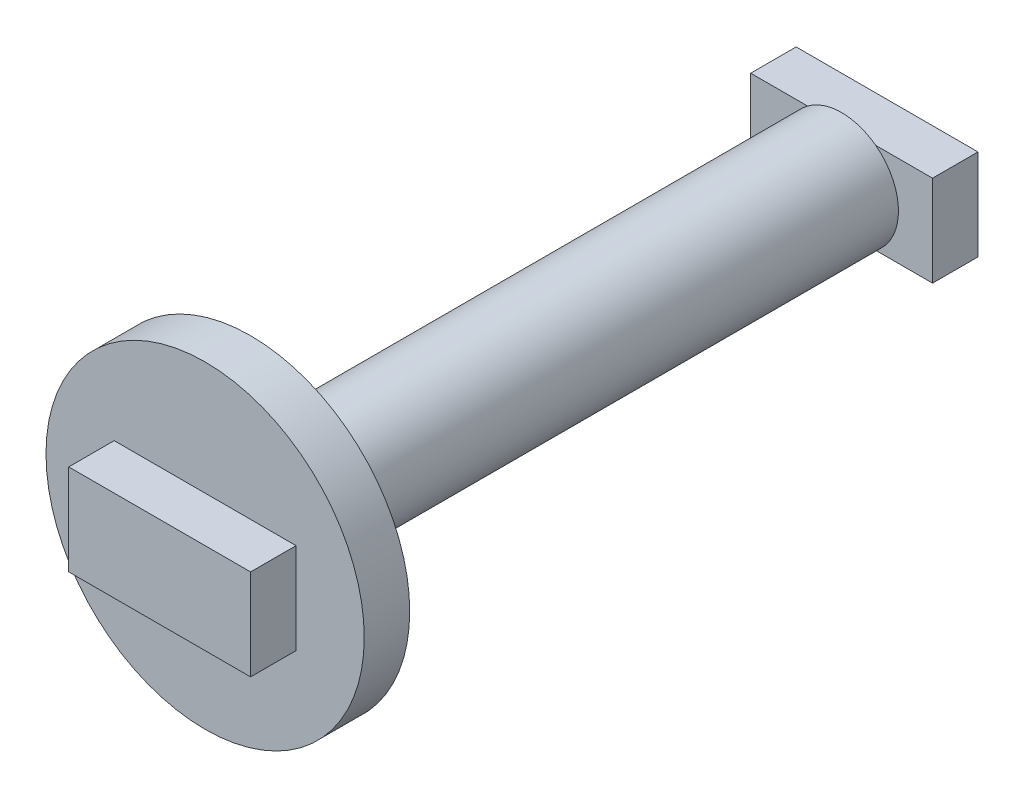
ISO-10303-21;
HEADER;
FILE_DESCRIPTION(('STEP AP214'),'2;1');
FILE_NAME('part.step','',(''),(''),'','','');
FILE_SCHEMA(('AUTOMOTIVE_DESIGN { 1 0 10303 214 1 1 1 1 }'));
ENDSEC;
DATA;
#1=APPLICATION_CONTEXT('core data for automotive mechanical design processes');
#2=APPLICATION_PROTOCOL_DEFINITION('international standard','automotive_design',2000,#1);
#3=PRODUCT_CONTEXT('',#1,'mechanical');
#4=PRODUCT('Part','Part','',(#3));
#5=PRODUCT_RELATED_PRODUCT_CATEGORY('part','',(#4));
#6=PRODUCT_DEFINITION_FORMATION('','',#4);
#7=PRODUCT_DEFINITION_CONTEXT('part definition',#1,'design');
#8=PRODUCT_DEFINITION('design','',#6,#7);
#9=PRODUCT_DEFINITION_SHAPE('','',#8);
#10=(LENGTH_UNIT() NAMED_UNIT(*) SI_UNIT(.MILLI.,.METRE.));
#11=(NAMED_UNIT(*) PLANE_ANGLE_UNIT() SI_UNIT($,.RADIAN.));
#12=(NAMED_UNIT(*) SI_UNIT($,.STERADIAN.) SOLID_ANGLE_UNIT());
#13=UNCERTAINTY_MEASURE_WITH_UNIT(LENGTH_MEASURE(1.E-05),#10,'distance_accuracy_value','');
#14=(GEOMETRIC_REPRESENTATION_CONTEXT(3) GLOBAL_UNCERTAINTY_ASSIGNED_CONTEXT((#13)) GLOBAL_UNIT_ASSIGNED_CONTEXT((#10,
#11,#12)) REPRESENTATION_CONTEXT('',''));
#15=CARTESIAN_POINT('',(0.,0.,0.));
#16=DIRECTION('',(0.,0.,1.));
#17=DIRECTION('',(1.,0.,0.));
#18=AXIS2_PLACEMENT_3D('',#15,#16,#17);
#19=CARTESIAN_POINT('',(0.,0.,0.));
#20=DIRECTION('',(0.,0.,1.));
#21=DIRECTION('',(1.,0.,0.));
#22=AXIS2_PLACEMENT_3D('',#19,#20,#21);
#23=PLANE('',#22);
#24=DIRECTION('',(1.,0.,0.));
#25=VECTOR('',#24,1.);
#26=CARTESIAN_POINT('',(-20.,10.,0.));
#27=LINE('',#26,#25);
#28=CARTESIAN_POINT('',(-7.5,10.,0.));
#29=VERTEX_POINT('',#28);
#30=CARTESIAN_POINT('',(7.5,10.,0.));
#31=VERTEX_POINT('',#30);
#32=EDGE_CURVE('E11',#29,#31,#27,.T.);
#33=ORIENTED_EDGE('',*,*,#32,.F.);
#34=CARTESIAN_POINT('',(0.,0.,0.));
#35=DIRECTION('',(0.,0.,1.));
#36=DIRECTION('',(1.,0.,0.));
#37=AXIS2_PLACEMENT_3D('',#34,#35,#36);
#38=CIRCLE('',#37,12.5);
#39=EDGE_CURVE('E37',#31,#29,#38,.T.);
#40=ORIENTED_EDGE('',*,*,#39,.F.);
#41=EDGE_LOOP('',(#33,#40));
#42=FACE_BOUND('',#41,.T.);
#43=ADVANCED_FACE('F33',(#42),#23,.F.);
#44=DIRECTION('',(-1.,0.,0.));
#45=VECTOR('',#44,1.);
#46=CARTESIAN_POINT('',(-20.,-10.,0.));
#47=LINE('',#46,#45);
#48=CARTESIAN_POINT('',(7.5,-10.,0.));
#49=VERTEX_POINT('',#48);
#50=CARTESIAN_POINT('',(-7.5,-10.,0.));
#51=VERTEX_POINT('',#50);
#52=EDGE_CURVE('E42',#49,#51,#47,.T.);
#53=ORIENTED_EDGE('',*,*,#52,.F.);
#54=EDGE_CURVE('E188',#51,#49,#38,.T.);
#55=ORIENTED_EDGE('',*,*,#54,.F.);
#56=EDGE_LOOP('',(#53,#55));
#57=FACE_BOUND('',#56,.T.);
#58=ADVANCED_FACE('F221',(#57),#23,.F.);
#59=CARTESIAN_POINT('',(0.,0.,140.));
#60=DIRECTION('',(0.,0.,1.));
#61=DIRECTION('',(1.,0.,0.));
#62=AXIS2_PLACEMENT_3D('',#59,#60,#61);
#63=PLANE('',#62);
#64=CARTESIAN_POINT('',(0.,0.,140.));
#65=DIRECTION('',(0.,0.,1.));
#66=DIRECTION('',(1.,0.,0.));
#67=AXIS2_PLACEMENT_3D('',#64,#65,#66);
#68=CIRCLE('',#67,35.);
#69=CARTESIAN_POINT('',(35.,0.,140.));
#70=VERTEX_POINT('',#69);
#71=EDGE_CURVE('E173',#70,#70,#68,.T.);
#72=ORIENTED_EDGE('',*,*,#71,.T.);
#73=EDGE_LOOP('',(#72));
#74=FACE_BOUND('',#73,.T.);
#75=DIRECTION('',(1.,0.,0.));
#76=VECTOR('',#75,1.);
#77=CARTESIAN_POINT('',(20.,-10.,140.));
#78=LINE('',#77,#76);
#79=CARTESIAN_POINT('',(-20.,-10.,140.));
#80=VERTEX_POINT('',#79);
#81=CARTESIAN_POINT('',(20.,-10.,140.));
#82=VERTEX_POINT('',#81);
#83=EDGE_CURVE('E141',#80,#82,#78,.T.);
#84=ORIENTED_EDGE('',*,*,#83,.F.);
#85=DIRECTION('',(0.,-1.,0.));
#86=VECTOR('',#85,1.);
#87=CARTESIAN_POINT('',(-20.,10.,140.));
#88=LINE('',#87,#86);
#89=CARTESIAN_POINT('',(-20.,10.,140.));
#90=VERTEX_POINT('',#89);
#91=EDGE_CURVE('E138',#90,#80,#88,.T.);
#92=ORIENTED_EDGE('',*,*,#91,.F.);
#93=DIRECTION('',(-1.,0.,0.));
#94=VECTOR('',#93,1.);
#95=CARTESIAN_POINT('',(20.,10.,140.));
#96=LINE('',#95,#94);
#97=CARTESIAN_POINT('',(20.,10.,140.));
#98=VERTEX_POINT('',#97);
#99=EDGE_CURVE('E151',#98,#90,#96,.T.);
#100=ORIENTED_EDGE('',*,*,#99,.F.);
#101=DIRECTION('',(0.,1.,0.));
#102=VECTOR('',#101,1.);
#103=CARTESIAN_POINT('',(20.,10.,140.));
#104=LINE('',#103,#102);
#105=EDGE_CURVE('E159',#82,#98,#104,.T.);
#106=ORIENTED_EDGE('',*,*,#105,.F.);
#107=EDGE_LOOP('',(#84,#92,#100,#106));
#108=FACE_BOUND('',#107,.T.);
#109=ADVANCED_FACE('F225',(#74,#108),#63,.T.);
#110=CARTESIAN_POINT('',(0.,0.,130.));
#111=DIRECTION('',(0.,0.,-1.));
#112=DIRECTION('',(-1.,0.,0.));
#113=AXIS2_PLACEMENT_3D('',#110,#111,#112);
#114=CYLINDRICAL_SURFACE('',#113,12.5);
#115=CARTESIAN_POINT('',(0.,0.,130.));
#116=DIRECTION('',(0.,0.,1.));
#117=DIRECTION('',(1.,0.,0.));
#118=AXIS2_PLACEMENT_3D('',#115,#116,#117);
#119=CIRCLE('',#118,12.5);
#120=CARTESIAN_POINT('',(12.5,0.,130.));
#121=VERTEX_POINT('',#120);
#122=EDGE_CURVE('E178',#121,#121,#119,.T.);
#123=ORIENTED_EDGE('',*,*,#122,.F.);
#124=EDGE_LOOP('',(#123));
#125=FACE_BOUND('',#124,.T.);
#126=ORIENTED_EDGE('',*,*,#39,.T.);
#127=EDGE_CURVE('E185',#29,#51,#38,.T.);
#128=ORIENTED_EDGE('',*,*,#127,.T.);
#129=ORIENTED_EDGE('',*,*,#54,.T.);
#130=EDGE_CURVE('E176',#49,#31,#38,.T.);
#131=ORIENTED_EDGE('',*,*,#130,.T.);
#132=EDGE_LOOP('',(#126,#128,#129,#131));
#133=FACE_BOUND('',#132,.T.);
#134=ADVANCED_FACE('F35',(#125,#133),#114,.T.);
#135=CARTESIAN_POINT('',(0.,0.,130.));
#136=DIRECTION('',(0.,0.,1.));
#137=DIRECTION('',(1.,0.,0.));
#138=AXIS2_PLACEMENT_3D('',#135,#136,#137);
#139=PLANE('',#138);
#140=CARTESIAN_POINT('',(0.,0.,130.));
#141=DIRECTION('',(0.,0.,1.));
#142=DIRECTION('',(1.,0.,0.));
#143=AXIS2_PLACEMENT_3D('',#140,#141,#142);
#144=CIRCLE('',#143,35.);
#145=CARTESIAN_POINT('',(35.,0.,130.));
#146=VERTEX_POINT('',#145);
#147=EDGE_CURVE('E172',#146,#146,#144,.T.);
#148=ORIENTED_EDGE('',*,*,#147,.F.);
#149=EDGE_LOOP('',(#148));
#150=FACE_BOUND('',#149,.T.);
#151=ORIENTED_EDGE('',*,*,#122,.T.);
#152=EDGE_LOOP('',(#151));
#153=FACE_BOUND('',#152,.T.);
#154=ADVANCED_FACE('F231',(#150,#153),#139,.F.);
#155=CARTESIAN_POINT('',(0.,0.,140.));
#156=DIRECTION('',(0.,0.,-1.));
#157=DIRECTION('',(-1.,0.,0.));
#158=AXIS2_PLACEMENT_3D('',#155,#156,#157);
#159=CYLINDRICAL_SURFACE('',#158,35.);
#160=ORIENTED_EDGE('',*,*,#71,.F.);
#161=EDGE_LOOP('',(#160));
#162=FACE_BOUND('',#161,.T.);
#163=ORIENTED_EDGE('',*,*,#147,.T.);
#164=EDGE_LOOP('',(#163));
#165=FACE_BOUND('',#164,.T.);
#166=ADVANCED_FACE('F227',(#162,#165),#159,.T.);
#167=CARTESIAN_POINT('',(-20.,10.,150.));
#168=DIRECTION('',(1.,0.,0.));
#169=DIRECTION('',(0.,1.,0.));
#170=AXIS2_PLACEMENT_3D('',#167,#168,#169);
#171=PLANE('',#170);
#172=ORIENTED_EDGE('',*,*,#91,.T.);
#173=DIRECTION('',(0.,0.,-1.));
#174=VECTOR('',#173,1.);
#175=CARTESIAN_POINT('',(-20.,-10.,150.));
#176=LINE('',#175,#174);
#177=CARTESIAN_POINT('',(-20.,-10.,150.));
#178=VERTEX_POINT('',#177);
#179=EDGE_CURVE('E170',#178,#80,#176,.T.);
#180=ORIENTED_EDGE('',*,*,#179,.F.);
#181=DIRECTION('',(0.,-1.,0.));
#182=VECTOR('',#181,1.);
#183=CARTESIAN_POINT('',(-20.,10.,150.));
#184=LINE('',#183,#182);
#185=CARTESIAN_POINT('',(-20.,10.,150.));
#186=VERTEX_POINT('',#185);
#187=EDGE_CURVE('E147',#186,#178,#184,.T.);
#188=ORIENTED_EDGE('',*,*,#187,.F.);
#189=DIRECTION('',(0.,0.,-1.));
#190=VECTOR('',#189,1.);
#191=CARTESIAN_POINT('',(-20.,10.,150.));
#192=LINE('',#191,#190);
#193=EDGE_CURVE('E156',#186,#90,#192,.T.);
#194=ORIENTED_EDGE('',*,*,#193,.T.);
#195=EDGE_LOOP('',(#172,#180,#188,#194));
#196=FACE_BOUND('',#195,.T.);
#197=ADVANCED_FACE('F230',(#196),#171,.F.);
#198=CARTESIAN_POINT('',(20.,-10.,150.));
#199=DIRECTION('',(0.,1.,0.));
#200=DIRECTION('',(-1.,0.,0.));
#201=AXIS2_PLACEMENT_3D('',#198,#199,#200);
#202=PLANE('',#201);
#203=ORIENTED_EDGE('',*,*,#83,.T.);
#204=DIRECTION('',(0.,0.,-1.));
#205=VECTOR('',#204,1.);
#206=CARTESIAN_POINT('',(20.,-10.,150.));
#207=LINE('',#206,#205);
#208=CARTESIAN_POINT('',(20.,-10.,150.));
#209=VERTEX_POINT('',#208);
#210=EDGE_CURVE('E167',#209,#82,#207,.T.);
#211=ORIENTED_EDGE('',*,*,#210,.F.);
#212=DIRECTION('',(1.,0.,0.));
#213=VECTOR('',#212,1.);
#214=CARTESIAN_POINT('',(20.,-10.,150.));
#215=LINE('',#214,#213);
#216=EDGE_CURVE('E150',#178,#209,#215,.T.);
#217=ORIENTED_EDGE('',*,*,#216,.F.);
#218=ORIENTED_EDGE('',*,*,#179,.T.);
#219=EDGE_LOOP('',(#203,#211,#217,#218));
#220=FACE_BOUND('',#219,.T.);
#221=ADVANCED_FACE('F241',(#220),#202,.F.);
#222=CARTESIAN_POINT('',(20.,10.,150.));
#223=DIRECTION('',(-1.,0.,0.));
#224=DIRECTION('',(0.,-1.,0.));
#225=AXIS2_PLACEMENT_3D('',#222,#223,#224);
#226=PLANE('',#225);
#227=ORIENTED_EDGE('',*,*,#105,.T.);
#228=DIRECTION('',(0.,0.,-1.));
#229=VECTOR('',#228,1.);
#230=CARTESIAN_POINT('',(20.,10.,150.));
#231=LINE('',#230,#229);
#232=CARTESIAN_POINT('',(20.,10.,150.));
#233=VERTEX_POINT('',#232);
#234=EDGE_CURVE('E165',#233,#98,#231,.T.);
#235=ORIENTED_EDGE('',*,*,#234,.F.);
#236=DIRECTION('',(0.,1.,0.));
#237=VECTOR('',#236,1.);
#238=CARTESIAN_POINT('',(20.,10.,150.));
#239=LINE('',#238,#237);
#240=EDGE_CURVE('E153',#209,#233,#239,.T.);
#241=ORIENTED_EDGE('',*,*,#240,.F.);
#242=ORIENTED_EDGE('',*,*,#210,.T.);
#243=EDGE_LOOP('',(#227,#235,#241,#242));
#244=FACE_BOUND('',#243,.T.);
#245=ADVANCED_FACE('F245',(#244),#226,.F.);
#246=CARTESIAN_POINT('',(20.,10.,150.));
#247=DIRECTION('',(0.,-1.,0.));
#248=DIRECTION('',(1.,0.,0.));
#249=AXIS2_PLACEMENT_3D('',#246,#247,#248);
#250=PLANE('',#249);
#251=ORIENTED_EDGE('',*,*,#99,.T.);
#252=ORIENTED_EDGE('',*,*,#193,.F.);
#253=DIRECTION('',(-1.,0.,0.));
#254=VECTOR('',#253,1.);
#255=CARTESIAN_POINT('',(20.,10.,150.));
#256=LINE('',#255,#254);
#257=EDGE_CURVE('E155',#233,#186,#256,.T.);
#258=ORIENTED_EDGE('',*,*,#257,.F.);
#259=ORIENTED_EDGE('',*,*,#234,.T.);
#260=EDGE_LOOP('',(#251,#252,#258,#259));
#261=FACE_BOUND('',#260,.T.);
#262=ADVANCED_FACE('F249',(#261),#250,.F.);
#263=CARTESIAN_POINT('',(0.,0.,150.));
#264=DIRECTION('',(0.,0.,-1.));
#265=DIRECTION('',(-1.,0.,0.));
#266=AXIS2_PLACEMENT_3D('',#263,#264,#265);
#267=PLANE('',#266);
#268=ORIENTED_EDGE('',*,*,#187,.T.);
#269=ORIENTED_EDGE('',*,*,#216,.T.);
#270=ORIENTED_EDGE('',*,*,#240,.T.);
#271=ORIENTED_EDGE('',*,*,#257,.T.);
#272=EDGE_LOOP('',(#268,#269,#270,#271));
#273=FACE_BOUND('',#272,.T.);
#274=ADVANCED_FACE('F253',(#273),#267,.F.);
#275=CARTESIAN_POINT('',(0.,0.,0.));
#276=DIRECTION('',(0.,0.,1.));
#277=DIRECTION('',(1.,0.,0.));
#278=AXIS2_PLACEMENT_3D('',#275,#276,#277);
#279=PLANE('',#278);
#280=ORIENTED_EDGE('',*,*,#127,.F.);
#281=CARTESIAN_POINT('',(-20.,10.,0.));
#282=VERTEX_POINT('',#281);
#283=EDGE_CURVE('E44',#282,#29,#27,.T.);
#284=ORIENTED_EDGE('',*,*,#283,.F.);
#285=DIRECTION('',(0.,1.,0.));
#286=VECTOR('',#285,1.);
#287=CARTESIAN_POINT('',(-20.,10.,0.));
#288=LINE('',#287,#286);
#289=CARTESIAN_POINT('',(-20.,-10.,0.));
#290=VERTEX_POINT('',#289);
#291=EDGE_CURVE('E194',#290,#282,#288,.T.);
#292=ORIENTED_EDGE('',*,*,#291,.F.);
#293=EDGE_CURVE('E184',#51,#290,#47,.T.);
#294=ORIENTED_EDGE('',*,*,#293,.F.);
#295=EDGE_LOOP('',(#280,#284,#292,#294));
#296=FACE_BOUND('',#295,.T.);
#297=ADVANCED_FACE('F209',(#296),#279,.T.);
#298=ORIENTED_EDGE('',*,*,#130,.F.);
#299=CARTESIAN_POINT('',(20.,-10.,0.));
#300=VERTEX_POINT('',#299);
#301=EDGE_CURVE('E183',#300,#49,#47,.T.);
#302=ORIENTED_EDGE('',*,*,#301,.F.);
#303=DIRECTION('',(0.,-1.,0.));
#304=VECTOR('',#303,1.);
#305=CARTESIAN_POINT('',(20.,10.,0.));
#306=LINE('',#305,#304);
#307=CARTESIAN_POINT('',(20.,10.,0.));
#308=VERTEX_POINT('',#307);
#309=EDGE_CURVE('E137',#308,#300,#306,.T.);
#310=ORIENTED_EDGE('',*,*,#309,.F.);
#311=EDGE_CURVE('E45',#31,#308,#27,.T.);
#312=ORIENTED_EDGE('',*,*,#311,.F.);
#313=EDGE_LOOP('',(#298,#302,#310,#312));
#314=FACE_BOUND('',#313,.T.);
#315=ADVANCED_FACE('F193',(#314),#279,.T.);
#316=CARTESIAN_POINT('',(20.,10.,-10.));
#317=DIRECTION('',(-1.,0.,0.));
#318=DIRECTION('',(0.,-1.,0.));
#319=AXIS2_PLACEMENT_3D('',#316,#317,#318);
#320=PLANE('',#319);
#321=ORIENTED_EDGE('',*,*,#309,.T.);
#322=DIRECTION('',(0.,0.,1.));
#323=VECTOR('',#322,1.);
#324=CARTESIAN_POINT('',(20.,-10.,-10.));
#325=LINE('',#324,#323);
#326=CARTESIAN_POINT('',(20.,-10.,-10.));
#327=VERTEX_POINT('',#326);
#328=EDGE_CURVE('E118',#327,#300,#325,.T.);
#329=ORIENTED_EDGE('',*,*,#328,.F.);
#330=DIRECTION('',(0.,-1.,0.));
#331=VECTOR('',#330,1.);
#332=CARTESIAN_POINT('',(20.,10.,-10.));
#333=LINE('',#332,#331);
#334=CARTESIAN_POINT('',(20.,10.,-10.));
#335=VERTEX_POINT('',#334);
#336=EDGE_CURVE('E125',#335,#327,#333,.T.);
#337=ORIENTED_EDGE('',*,*,#336,.F.);
#338=DIRECTION('',(0.,0.,1.));
#339=VECTOR('',#338,1.);
#340=CARTESIAN_POINT('',(20.,10.,-10.));
#341=LINE('',#340,#339);
#342=EDGE_CURVE('E200',#335,#308,#341,.T.);
#343=ORIENTED_EDGE('',*,*,#342,.T.);
#344=EDGE_LOOP('',(#321,#329,#337,#343));
#345=FACE_BOUND('',#344,.T.);
#346=ADVANCED_FACE('F135',(#345),#320,.F.);
#347=CARTESIAN_POINT('',(-20.,-10.,-10.));
#348=DIRECTION('',(0.,1.,0.));
#349=DIRECTION('',(-1.,0.,0.));
#350=AXIS2_PLACEMENT_3D('',#347,#348,#349);
#351=PLANE('',#350);
#352=ORIENTED_EDGE('',*,*,#301,.T.);
#353=ORIENTED_EDGE('',*,*,#52,.T.);
#354=ORIENTED_EDGE('',*,*,#293,.T.);
#355=DIRECTION('',(0.,0.,1.));
#356=VECTOR('',#355,1.);
#357=CARTESIAN_POINT('',(-20.,-10.,-10.));
#358=LINE('',#357,#356);
#359=CARTESIAN_POINT('',(-20.,-10.,-10.));
#360=VERTEX_POINT('',#359);
#361=EDGE_CURVE('E121',#360,#290,#358,.T.);
#362=ORIENTED_EDGE('',*,*,#361,.F.);
#363=DIRECTION('',(-1.,0.,0.));
#364=VECTOR('',#363,1.);
#365=CARTESIAN_POINT('',(-20.,-10.,-10.));
#366=LINE('',#365,#364);
#367=EDGE_CURVE('E113',#327,#360,#366,.T.);
#368=ORIENTED_EDGE('',*,*,#367,.F.);
#369=ORIENTED_EDGE('',*,*,#328,.T.);
#370=EDGE_LOOP('',(#352,#353,#354,#362,#368,#369));
#371=FACE_BOUND('',#370,.T.);
#372=ADVANCED_FACE('F116',(#371),#351,.F.);
#373=CARTESIAN_POINT('',(-20.,10.,-10.));
#374=DIRECTION('',(1.,0.,0.));
#375=DIRECTION('',(0.,1.,0.));
#376=AXIS2_PLACEMENT_3D('',#373,#374,#375);
#377=PLANE('',#376);
#378=ORIENTED_EDGE('',*,*,#291,.T.);
#379=DIRECTION('',(0.,0.,1.));
#380=VECTOR('',#379,1.);
#381=CARTESIAN_POINT('',(-20.,10.,-10.));
#382=LINE('',#381,#380);
#383=CARTESIAN_POINT('',(-20.,10.,-10.));
#384=VERTEX_POINT('',#383);
#385=EDGE_CURVE('E143',#384,#282,#382,.T.);
#386=ORIENTED_EDGE('',*,*,#385,.F.);
#387=DIRECTION('',(0.,1.,0.));
#388=VECTOR('',#387,1.);
#389=CARTESIAN_POINT('',(-20.,10.,-10.));
#390=LINE('',#389,#388);
#391=EDGE_CURVE('E124',#360,#384,#390,.T.);
#392=ORIENTED_EDGE('',*,*,#391,.F.);
#393=ORIENTED_EDGE('',*,*,#361,.T.);
#394=EDGE_LOOP('',(#378,#386,#392,#393));
#395=FACE_BOUND('',#394,.T.);
#396=ADVANCED_FACE('F210',(#395),#377,.F.);
#397=CARTESIAN_POINT('',(-20.,10.,-10.));
#398=DIRECTION('',(0.,-1.,0.));
#399=DIRECTION('',(1.,0.,0.));
#400=AXIS2_PLACEMENT_3D('',#397,#398,#399);
#401=PLANE('',#400);
#402=ORIENTED_EDGE('',*,*,#283,.T.);
#403=ORIENTED_EDGE('',*,*,#32,.T.);
#404=ORIENTED_EDGE('',*,*,#311,.T.);
#405=ORIENTED_EDGE('',*,*,#342,.F.);
#406=DIRECTION('',(1.,0.,0.));
#407=VECTOR('',#406,1.);
#408=CARTESIAN_POINT('',(-20.,10.,-10.));
#409=LINE('',#408,#407);
#410=EDGE_CURVE('E130',#384,#335,#409,.T.);
#411=ORIENTED_EDGE('',*,*,#410,.F.);
#412=ORIENTED_EDGE('',*,*,#385,.T.);
#413=EDGE_LOOP('',(#402,#403,#404,#405,#411,#412));
#414=FACE_BOUND('',#413,.T.);
#415=ADVANCED_FACE('F205',(#414),#401,.F.);
#416=CARTESIAN_POINT('',(0.,0.,-10.));
#417=DIRECTION('',(0.,0.,1.));
#418=DIRECTION('',(1.,0.,0.));
#419=AXIS2_PLACEMENT_3D('',#416,#417,#418);
#420=PLANE('',#419);
#421=ORIENTED_EDGE('',*,*,#336,.T.);
#422=ORIENTED_EDGE('',*,*,#367,.T.);
#423=ORIENTED_EDGE('',*,*,#391,.T.);
#424=ORIENTED_EDGE('',*,*,#410,.T.);
#425=EDGE_LOOP('',(#421,#422,#423,#424));
#426=FACE_BOUND('',#425,.T.);
#427=ADVANCED_FACE('F128',(#426),#420,.F.);
#428=CLOSED_SHELL('',(#43,#58,#109,#134,#154,#166,#197,#221,#245,#262,#274,#297,#315,#346,#372,
#396,#415,#427));
#429=MANIFOLD_SOLID_BREP('B2',#428);
#430=ADVANCED_BREP_SHAPE_REPRESENTATION('',(#18,#429),#14);
#431=SHAPE_DEFINITION_REPRESENTATION(#9,#430);
ENDSEC;
END-ISO-10303-21;
